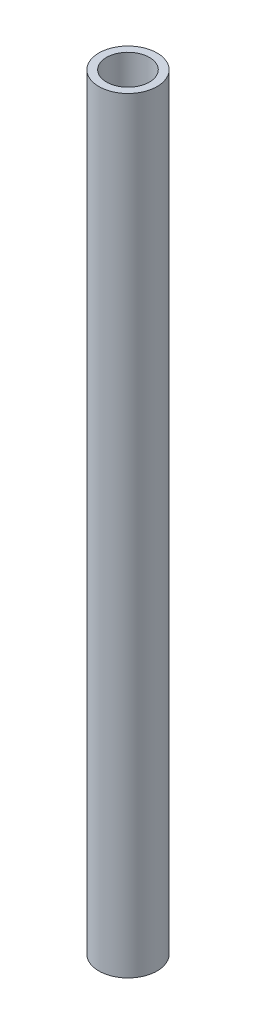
ISO-10303-21;
HEADER;
FILE_DESCRIPTION(('STEP AP214'),'2;1');
FILE_NAME('part.step','',(''),(''),'','','');
FILE_SCHEMA(('AUTOMOTIVE_DESIGN { 1 0 10303 214 1 1 1 1 }'));
ENDSEC;
DATA;
#1=APPLICATION_CONTEXT('core data for automotive mechanical design processes');
#2=APPLICATION_PROTOCOL_DEFINITION('international standard','automotive_design',2000,#1);
#3=PRODUCT_CONTEXT('',#1,'mechanical');
#4=PRODUCT('Part','Part','',(#3));
#5=PRODUCT_RELATED_PRODUCT_CATEGORY('part','',(#4));
#6=PRODUCT_DEFINITION_FORMATION('','',#4);
#7=PRODUCT_DEFINITION_CONTEXT('part definition',#1,'design');
#8=PRODUCT_DEFINITION('design','',#6,#7);
#9=PRODUCT_DEFINITION_SHAPE('','',#8);
#10=(LENGTH_UNIT() NAMED_UNIT(*) SI_UNIT(.MILLI.,.METRE.));
#11=(NAMED_UNIT(*) PLANE_ANGLE_UNIT() SI_UNIT($,.RADIAN.));
#12=(NAMED_UNIT(*) SI_UNIT($,.STERADIAN.) SOLID_ANGLE_UNIT());
#13=UNCERTAINTY_MEASURE_WITH_UNIT(LENGTH_MEASURE(1.E-05),#10,'distance_accuracy_value','');
#14=(GEOMETRIC_REPRESENTATION_CONTEXT(3) GLOBAL_UNCERTAINTY_ASSIGNED_CONTEXT((#13)) GLOBAL_UNIT_ASSIGNED_CONTEXT((#10,
#11,#12)) REPRESENTATION_CONTEXT('',''));
#15=CARTESIAN_POINT('',(0.,0.,0.));
#16=DIRECTION('',(0.,0.,1.));
#17=DIRECTION('',(1.,0.,0.));
#18=AXIS2_PLACEMENT_3D('',#15,#16,#17);
#19=CARTESIAN_POINT('',(5.00000000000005,0.,0.));
#20=DIRECTION('',(0.,1.,0.));
#21=DIRECTION('',(-1.,0.,0.));
#22=AXIS2_PLACEMENT_3D('',#19,#20,#21);
#23=PLANE('',#22);
#24=CARTESIAN_POINT('',(19.0000000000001,0.,0.));
#25=DIRECTION('',(0.,1.,0.));
#26=DIRECTION('',(-1.,0.,0.));
#27=AXIS2_PLACEMENT_3D('',#24,#25,#26);
#28=CIRCLE('',#27,19.0000000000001);
#29=CARTESIAN_POINT('',(0.,0.,0.));
#30=VERTEX_POINT('',#29);
#31=EDGE_CURVE('E10',#30,#30,#28,.T.);
#32=ORIENTED_EDGE('',*,*,#31,.T.);
#33=EDGE_LOOP('',(#32));
#34=FACE_BOUND('',#33,.T.);
#35=CARTESIAN_POINT('',(19.0000000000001,0.,0.));
#36=DIRECTION('',(0.,1.,0.));
#37=DIRECTION('',(-1.,0.,0.));
#38=AXIS2_PLACEMENT_3D('',#35,#36,#37);
#39=CIRCLE('',#38,14.);
#40=CARTESIAN_POINT('',(5.00000000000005,0.,0.));
#41=VERTEX_POINT('',#40);
#42=EDGE_CURVE('E47',#41,#41,#39,.T.);
#43=ORIENTED_EDGE('',*,*,#42,.F.);
#44=EDGE_LOOP('',(#43));
#45=FACE_BOUND('',#44,.T.);
#46=ADVANCED_FACE('F33',(#34,#45),#23,.T.);
#47=CARTESIAN_POINT('',(19.0000000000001,0.,0.));
#48=DIRECTION('',(0.,1.,0.));
#49=DIRECTION('',(-1.,0.,0.));
#50=AXIS2_PLACEMENT_3D('',#47,#48,#49);
#51=CYLINDRICAL_SURFACE('',#50,19.0000000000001);
#52=CARTESIAN_POINT('',(19.0000000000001,-500.,0.));
#53=DIRECTION('',(0.,1.,0.));
#54=DIRECTION('',(-1.,0.,0.));
#55=AXIS2_PLACEMENT_3D('',#52,#53,#54);
#56=CIRCLE('',#55,19.0000000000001);
#57=CARTESIAN_POINT('',(0.,-500.,0.));
#58=VERTEX_POINT('',#57);
#59=EDGE_CURVE('E39',#58,#58,#56,.T.);
#60=ORIENTED_EDGE('',*,*,#59,.T.);
#61=EDGE_LOOP('',(#60));
#62=FACE_BOUND('',#61,.T.);
#63=ORIENTED_EDGE('',*,*,#31,.F.);
#64=EDGE_LOOP('',(#63));
#65=FACE_BOUND('',#64,.T.);
#66=ADVANCED_FACE('F57',(#62,#65),#51,.T.);
#67=CARTESIAN_POINT('',(0.,-500.,0.));
#68=DIRECTION('',(0.,-1.,0.));
#69=DIRECTION('',(1.,0.,0.));
#70=AXIS2_PLACEMENT_3D('',#67,#68,#69);
#71=PLANE('',#70);
#72=CARTESIAN_POINT('',(19.0000000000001,-500.,0.));
#73=DIRECTION('',(0.,1.,0.));
#74=DIRECTION('',(-1.,0.,0.));
#75=AXIS2_PLACEMENT_3D('',#72,#73,#74);
#76=CIRCLE('',#75,14.0000000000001);
#77=CARTESIAN_POINT('',(5.00000000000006,-500.,0.));
#78=VERTEX_POINT('',#77);
#79=EDGE_CURVE('E43',#78,#78,#76,.T.);
#80=ORIENTED_EDGE('',*,*,#79,.T.);
#81=EDGE_LOOP('',(#80));
#82=FACE_BOUND('',#81,.T.);
#83=ORIENTED_EDGE('',*,*,#59,.F.);
#84=EDGE_LOOP('',(#83));
#85=FACE_BOUND('',#84,.T.);
#86=ADVANCED_FACE('F61',(#82,#85),#71,.T.);
#87=CARTESIAN_POINT('',(19.0000000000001,0.,0.));
#88=DIRECTION('',(0.,1.,0.));
#89=DIRECTION('',(-1.,0.,0.));
#90=AXIS2_PLACEMENT_3D('',#87,#88,#89);
#91=CYLINDRICAL_SURFACE('',#90,14.);
#92=ORIENTED_EDGE('',*,*,#42,.T.);
#93=EDGE_LOOP('',(#92));
#94=FACE_BOUND('',#93,.T.);
#95=ORIENTED_EDGE('',*,*,#79,.F.);
#96=EDGE_LOOP('',(#95));
#97=FACE_BOUND('',#96,.T.);
#98=ADVANCED_FACE('F53',(#94,#97),#91,.F.);
#99=CLOSED_SHELL('',(#46,#66,#86,#98));
#100=MANIFOLD_SOLID_BREP('B2',#99);
#101=ADVANCED_BREP_SHAPE_REPRESENTATION('',(#18,#100),#14);
#102=SHAPE_DEFINITION_REPRESENTATION(#9,#101);
ENDSEC;
END-ISO-10303-21;
